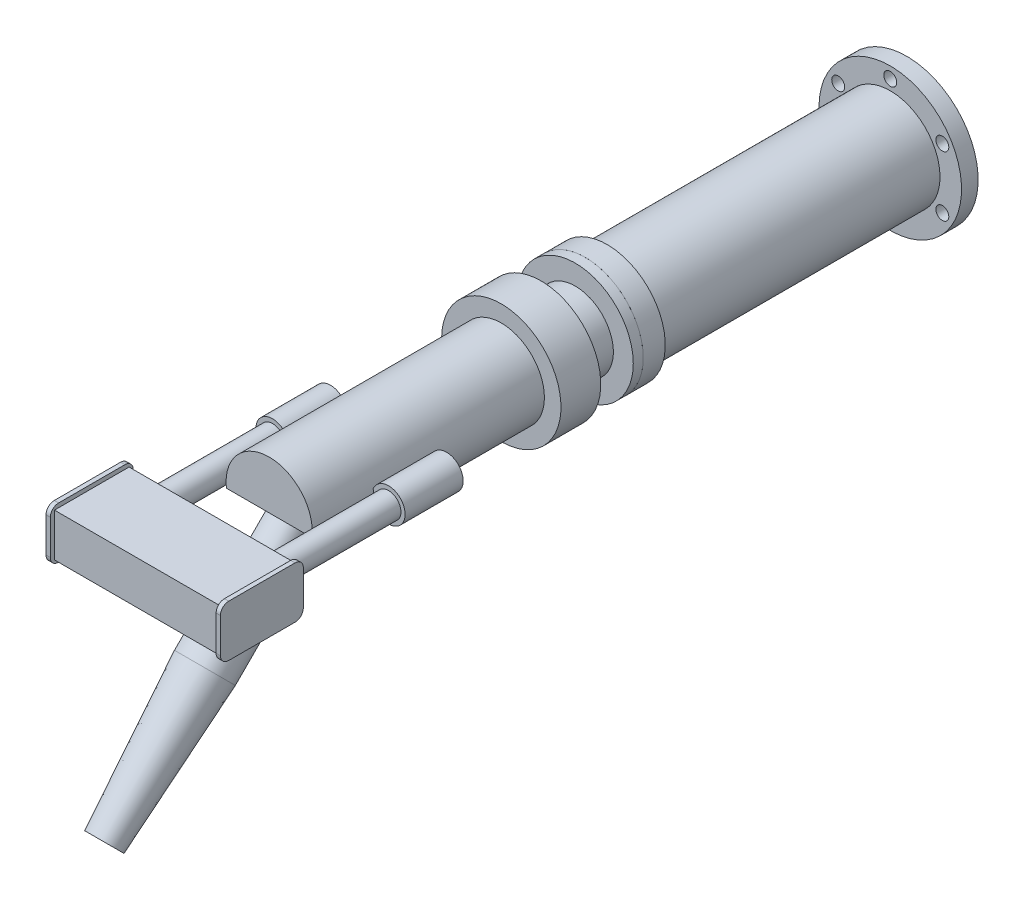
from build123d import *

# Parameters (mm, degrees)
SKETCH1_R          = 45.72
EXTRUDE1_DEPTH     = 30.48
SKETCH2_R          = 33.02
EXTRUDE2_DEPTH     = 177.8
SKETCH4_R          = 28.0035
CUT_EXTRUDE1_DEPTH = 77.851
SKETCH10_R         = 12.7
EXTRUDE9_DEPTH     = 44.45
SKETCH7_R          = 9.525
EXTRUDE6_DEPTH     = 90.805
SKETCH8_W          = 127
SKETCH8_H          = 33.02
EXTRUDE7_DEPTH     = 57.15
EXTRUDE8_DEPTH     = 3.302
CUT_EXTRUDE2_DEPTH = 34.925
SKETCH22_R         = 44.45
EXTRUDE10_DEPTH    = 7.62
SKETCH23_R         = 29.21
EXTRUDE11_DEPTH    = 38.1
SKETCH24_R         = 44.45
EXTRUDE12_DEPTH    = 16.891
SKETCH25_R         = 38.1
EXTRUDE13_DEPTH    = 216.789
SKETCH26_R         = 54.61
EXTRUDE14_DEPTH    = 12.7
SKETCH27_R         = 4.9657
CUT_EXTRUDE3_DEPTH = 12.7
CIRPATTERN1_COUNT  = 6


with BuildPart() as part:
    # Sketch1 → Extrude1 (new body)
    with BuildSketch(Plane.XY):
        with Locations(Location((0, 0, 0), (0, 0, 180))):
            Circle(SKETCH1_R)
    extrude(amount=EXTRUDE1_DEPTH)

    # Sketch2 → Extrude2 (add)
    with BuildSketch(Plane.XY.offset(30.48)):
        Circle(SKETCH2_R)
    extrude(amount=EXTRUDE2_DEPTH)

    # Sketch4 → Cut-Extrude1 (cut)
    with BuildSketch(Plane(origin=(0, 0, 0), x_dir=(-1, 0, 0), z_dir=(0, 0, -1))):
        Circle(SKETCH4_R)
    extrude(amount=-CUT_EXTRUDE1_DEPTH, mode=Mode.SUBTRACT)

    # Sketch11 → Cut-Extrude2 (cut, symmetric)
    with BuildSketch(Plane(origin=(0, 0, 0), x_dir=(0, 0, -1), z_dir=(1, 0, 0))):
        Polygon((-210.962976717, -1.381023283), (-171.45, -40.894), (-210.962976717, -40.894), align=None)
    extrude(amount=CUT_EXTRUDE2_DEPTH, both=True, mode=Mode.SUBTRACT)

    # Sketch21 → Revolve1 (revolve)
    with BuildSketch(Plane(origin=(0, 0, 0), x_dir=(0, 0, -1), z_dir=(1, 0, 0)), mode=Mode.PRIVATE) as revolve1_sk:
        Polygon((-193.802, -18.542), (-203.71441017, -8.62958983), (-215.667363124, -20.582542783), (-219.225337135, -17.024568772), (-270.973429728, -68.772661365), (-343.252731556, -150.579355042), (-334.546043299, -159.286043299), align=None)
    revolve(revolve1_sk.sketch.rotate(Axis((0, -97.753972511, 273.013972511), (0, 0.7071067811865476, -0.7071067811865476)), 180), axis=Axis((0, -97.753972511, 273.013972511), (0, 0.7071067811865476, -0.7071067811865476)))



with BuildPart() as body_2:
    # Sketch10 → Extrude9 (new body)
    with BuildSketch(Plane.XY.offset(116.84)):
        with Locations((44.45, 0)):
            Circle(SKETCH10_R)
    extrude(amount=EXTRUDE9_DEPTH)


with BuildPart() as body_3:
    # Sketch7 → Extrude6 (new body)
    with BuildSketch(Plane.XY.offset(161.29)):
        with Locations((44.45, 0)):
            Circle(SKETCH7_R)
    extrude(amount=EXTRUDE6_DEPTH)


with BuildPart() as body_4:
    # Sketch8 → Extrude7 (new body)
    with BuildSketch(Plane.XY.offset(252.095)):
        Rectangle(SKETCH8_W, SKETCH8_H)
    extrude(amount=EXTRUDE7_DEPTH)


with BuildPart() as body_5:
    # Sketch9 → Extrude8 (new body)
    with BuildSketch(Plane(origin=(63.5, 0, 0), x_dir=(0, 0, -1), z_dir=(1, 0, 0))):
        with BuildLine():
            Line((-248.92, -13.335), (-248.92, 13.335))
            ThreePointArc((-248.92, 13.335), (-250.779871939, 17.825128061), (-255.27, 19.685))
            Line((-255.27, 19.685), (-306.07, 19.685))
            ThreePointArc((-306.07, 19.685), (-310.560128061, 17.825128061), (-312.42, 13.335))
            Line((-312.42, 13.335), (-312.42, -13.335))
            ThreePointArc((-312.42, -13.335), (-310.560128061, -17.825128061), (-306.07, -19.685))
            Line((-306.07, -19.685), (-255.27, -19.685))
            ThreePointArc((-255.27, -19.685), (-250.779871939, -17.825128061), (-248.92, -13.335))
        make_face()
    extrude(amount=EXTRUDE8_DEPTH)


with BuildPart() as body_6:
    # Mirror1: mirrored copy
    add(body_2.part.mirror(Plane(origin=(0, 0, 0), x_dir=(0, 0, 1), z_dir=(1, 0, 0))))


with BuildPart() as body_7:
    # Mirror1 2: mirrored copy
    add(body_3.part.mirror(Plane(origin=(0, 0, 0), x_dir=(0, 0, 1), z_dir=(1, 0, 0))))


with BuildPart() as body_8:
    # Mirror1 3: mirrored copy
    add(body_5.part.mirror(Plane(origin=(0, 0, 0), x_dir=(0, 0, 1), z_dir=(1, 0, 0))))


with BuildPart() as body_9:
    # Sketch22 → Extrude10 (new body)
    with BuildSketch(Plane(origin=(0, 0, -26.162), x_dir=(-1, 0, 0), z_dir=(0, 0, -1))):
        with Locations(Location((0, 0, 0), (0, 0, 180))):
            Circle(SKETCH22_R)
    extrude(amount=EXTRUDE10_DEPTH)


with BuildPart() as part_1:
    add(part.part)

    add(body_9.part)  # Extrude11 merges body 9
    # Sketch23 → Extrude11 (add)
    with BuildSketch(Plane(origin=(0, 0, -33.782), x_dir=(-1, 0, 0), z_dir=(0, 0, -1))):
        Circle(SKETCH23_R)
    extrude(amount=-EXTRUDE11_DEPTH)


with BuildPart() as body_9_2:
    # Sketch24 → Extrude12 (new body)
    with BuildSketch(Plane(origin=(0, 0, -33.782), x_dir=(-1, 0, 0), z_dir=(0, 0, -1))):
        Circle(SKETCH24_R)
    extrude(amount=EXTRUDE12_DEPTH)

    # Sketch25 → Extrude13 (add)
    with BuildSketch(Plane(origin=(0, 0, -50.673), x_dir=(-1, 0, 0), z_dir=(0, 0, -1))):
        Circle(SKETCH25_R)
    extrude(amount=EXTRUDE13_DEPTH)

    # Sketch26 → Extrude14 (add)
    with BuildSketch(Plane(origin=(0, 0, -267.462), x_dir=(-1, 0, 0), z_dir=(0, 0, -1))):
        Circle(SKETCH26_R)
    extrude(amount=EXTRUDE14_DEPTH)

    # Sketch27 → Cut-Extrude3 (cut)
    with BuildSketch(Plane(origin=(0, 0, -280.162), x_dir=(-1, 0, 0), z_dir=(0, 0, -1))):
        with Locations((0, 46.0375)):
            Circle(SKETCH27_R)
    cut_extrude3 = extrude(amount=-CUT_EXTRUDE3_DEPTH, mode=Mode.SUBTRACT)

    # CirPattern1: Cut-Extrude3 ×6 about axis
    cirpattern1_axis = Axis((0, 0, 0), (0, 0, 1))
    for i in range(1, CIRPATTERN1_COUNT):
        add(cut_extrude3.rotate(cirpattern1_axis, i * 360 / CIRPATTERN1_COUNT), mode=Mode.SUBTRACT)


solid = Compound([body_2.part, body_3.part, body_4.part, body_5.part, body_6.part, body_7.part, body_8.part, part_1.part, body_9_2.part])
